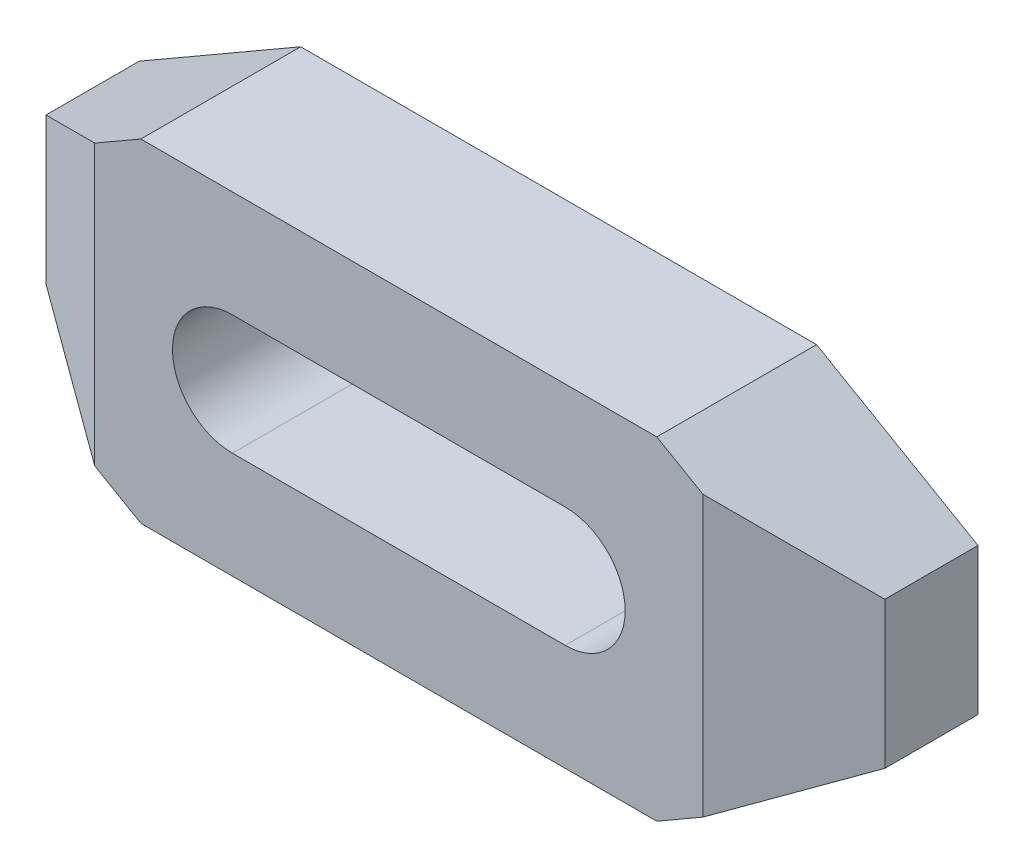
ISO-10303-21;
HEADER;
FILE_DESCRIPTION(('STEP AP214'),'2;1');
FILE_NAME('part.step','',(''),(''),'','','');
FILE_SCHEMA(('AUTOMOTIVE_DESIGN { 1 0 10303 214 1 1 1 1 }'));
ENDSEC;
DATA;
#1=APPLICATION_CONTEXT('core data for automotive mechanical design processes');
#2=APPLICATION_PROTOCOL_DEFINITION('international standard','automotive_design',2000,#1);
#3=PRODUCT_CONTEXT('',#1,'mechanical');
#4=PRODUCT('Part','Part','',(#3));
#5=PRODUCT_RELATED_PRODUCT_CATEGORY('part','',(#4));
#6=PRODUCT_DEFINITION_FORMATION('','',#4);
#7=PRODUCT_DEFINITION_CONTEXT('part definition',#1,'design');
#8=PRODUCT_DEFINITION('design','',#6,#7);
#9=PRODUCT_DEFINITION_SHAPE('','',#8);
#10=(LENGTH_UNIT() NAMED_UNIT(*) SI_UNIT(.MILLI.,.METRE.));
#11=(NAMED_UNIT(*) PLANE_ANGLE_UNIT() SI_UNIT($,.RADIAN.));
#12=(NAMED_UNIT(*) SI_UNIT($,.STERADIAN.) SOLID_ANGLE_UNIT());
#13=UNCERTAINTY_MEASURE_WITH_UNIT(LENGTH_MEASURE(1.E-05),#10,'distance_accuracy_value','');
#14=(GEOMETRIC_REPRESENTATION_CONTEXT(3) GLOBAL_UNCERTAINTY_ASSIGNED_CONTEXT((#13)) GLOBAL_UNIT_ASSIGNED_CONTEXT((#10,
#11,#12)) REPRESENTATION_CONTEXT('',''));
#15=CARTESIAN_POINT('',(0.,0.,0.));
#16=DIRECTION('',(0.,0.,1.));
#17=DIRECTION('',(1.,0.,0.));
#18=AXIS2_PLACEMENT_3D('',#15,#16,#17);
#19=CARTESIAN_POINT('',(0.,-23.6865334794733,12.));
#20=DIRECTION('',(0.,0.,-1.));
#21=DIRECTION('',(-1.,0.,0.));
#22=AXIS2_PLACEMENT_3D('',#19,#20,#21);
#23=PLANE('',#22);
#24=CARTESIAN_POINT('',(12.5,0.,12.));
#25=DIRECTION('',(0.,0.,1.));
#26=DIRECTION('',(1.,0.,0.));
#27=AXIS2_PLACEMENT_3D('',#24,#25,#26);
#28=CIRCLE('',#27,4.5);
#29=CARTESIAN_POINT('',(12.5,-4.5,12.));
#30=VERTEX_POINT('',#29);
#31=CARTESIAN_POINT('',(12.5,4.5,12.));
#32=VERTEX_POINT('',#31);
#33=EDGE_CURVE('E221',#30,#32,#28,.T.);
#34=ORIENTED_EDGE('',*,*,#33,.F.);
#35=DIRECTION('',(-1.,0.,0.));
#36=VECTOR('',#35,1.);
#37=CARTESIAN_POINT('',(12.5,-4.5,12.));
#38=LINE('',#37,#36);
#39=CARTESIAN_POINT('',(-12.5,-4.5,12.));
#40=VERTEX_POINT('',#39);
#41=EDGE_CURVE('E220',#30,#40,#38,.T.);
#42=ORIENTED_EDGE('',*,*,#41,.T.);
#43=CARTESIAN_POINT('',(-12.5,0.,12.));
#44=DIRECTION('',(0.,0.,1.));
#45=DIRECTION('',(1.,0.,0.));
#46=AXIS2_PLACEMENT_3D('',#43,#44,#45);
#47=CIRCLE('',#46,4.5);
#48=CARTESIAN_POINT('',(-12.5,4.5,12.));
#49=VERTEX_POINT('',#48);
#50=EDGE_CURVE('E228',#49,#40,#47,.T.);
#51=ORIENTED_EDGE('',*,*,#50,.F.);
#52=DIRECTION('',(-1.,0.,0.));
#53=VECTOR('',#52,1.);
#54=CARTESIAN_POINT('',(12.5,4.5,12.));
#55=LINE('',#54,#53);
#56=EDGE_CURVE('E224',#32,#49,#55,.T.);
#57=ORIENTED_EDGE('',*,*,#56,.F.);
#58=EDGE_LOOP('',(#34,#42,#51,#57));
#59=FACE_BOUND('',#58,.T.);
#60=DIRECTION('',(0.,1.,0.));
#61=VECTOR('',#60,1.);
#62=CARTESIAN_POINT('',(-22.8397459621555,-23.6865334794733,12.));
#63=LINE('',#62,#61);
#64=CARTESIAN_POINT('',(-22.8397459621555,-10.5,12.));
#65=VERTEX_POINT('',#64);
#66=CARTESIAN_POINT('',(-22.8397459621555,10.5,12.));
#67=VERTEX_POINT('',#66);
#68=EDGE_CURVE('E115',#65,#67,#63,.T.);
#69=ORIENTED_EDGE('',*,*,#68,.F.);
#70=DIRECTION('',(-0.866025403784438,0.5,0.));
#71=VECTOR('',#70,1.);
#72=CARTESIAN_POINT('',(-19.3756443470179,-12.5,12.));
#73=LINE('',#72,#71);
#74=CARTESIAN_POINT('',(-19.3756443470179,-12.5,12.));
#75=VERTEX_POINT('',#74);
#76=EDGE_CURVE('E174',#75,#65,#73,.T.);
#77=ORIENTED_EDGE('',*,*,#76,.F.);
#78=DIRECTION('',(-1.,0.,0.));
#79=VECTOR('',#78,1.);
#80=CARTESIAN_POINT('',(19.3756443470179,-12.5,12.));
#81=LINE('',#80,#79);
#82=CARTESIAN_POINT('',(19.3756443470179,-12.5,12.));
#83=VERTEX_POINT('',#82);
#84=EDGE_CURVE('E177',#83,#75,#81,.T.);
#85=ORIENTED_EDGE('',*,*,#84,.F.);
#86=DIRECTION('',(-0.866025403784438,-0.5,0.));
#87=VECTOR('',#86,1.);
#88=CARTESIAN_POINT('',(31.5,-5.5,12.));
#89=LINE('',#88,#87);
#90=CARTESIAN_POINT('',(22.8397459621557,-10.5,12.));
#91=VERTEX_POINT('',#90);
#92=EDGE_CURVE('E157',#91,#83,#89,.T.);
#93=ORIENTED_EDGE('',*,*,#92,.F.);
#94=DIRECTION('',(0.,1.,0.));
#95=VECTOR('',#94,1.);
#96=CARTESIAN_POINT('',(22.8397459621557,-23.6865334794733,12.));
#97=LINE('',#96,#95);
#98=CARTESIAN_POINT('',(22.8397459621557,10.5,12.));
#99=VERTEX_POINT('',#98);
#100=EDGE_CURVE('E146',#91,#99,#97,.T.);
#101=ORIENTED_EDGE('',*,*,#100,.T.);
#102=DIRECTION('',(0.866025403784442,-0.5,0.));
#103=VECTOR('',#102,1.);
#104=CARTESIAN_POINT('',(19.3756443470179,12.5,12.));
#105=LINE('',#104,#103);
#106=CARTESIAN_POINT('',(19.3756443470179,12.5,12.));
#107=VERTEX_POINT('',#106);
#108=EDGE_CURVE('E155',#107,#99,#105,.T.);
#109=ORIENTED_EDGE('',*,*,#108,.F.);
#110=DIRECTION('',(1.,0.,0.));
#111=VECTOR('',#110,1.);
#112=CARTESIAN_POINT('',(-19.3756443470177,12.5,12.));
#113=LINE('',#112,#111);
#114=CARTESIAN_POINT('',(-19.3756443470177,12.5,12.));
#115=VERTEX_POINT('',#114);
#116=EDGE_CURVE('E164',#115,#107,#113,.T.);
#117=ORIENTED_EDGE('',*,*,#116,.F.);
#118=DIRECTION('',(0.866025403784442,0.5,0.));
#119=VECTOR('',#118,1.);
#120=CARTESIAN_POINT('',(-31.5,5.5,12.));
#121=LINE('',#120,#119);
#122=EDGE_CURVE('E167',#67,#115,#121,.T.);
#123=ORIENTED_EDGE('',*,*,#122,.F.);
#124=EDGE_LOOP('',(#69,#77,#85,#93,#101,#109,#117,#123));
#125=FACE_BOUND('',#124,.T.);
#126=ADVANCED_FACE('F14',(#59,#125),#23,.F.);
#127=CARTESIAN_POINT('',(-31.5,5.5,12.));
#128=DIRECTION('',(-0.5,0.866025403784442,0.));
#129=DIRECTION('',(-0.866025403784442,-0.5,0.));
#130=AXIS2_PLACEMENT_3D('',#127,#128,#129);
#131=PLANE('',#130);
#132=DIRECTION('',(0.,0.,-1.));
#133=VECTOR('',#132,1.);
#134=CARTESIAN_POINT('',(-31.5,5.5,12.));
#135=LINE('',#134,#133);
#136=CARTESIAN_POINT('',(-31.5,5.5,7.));
#137=VERTEX_POINT('',#136);
#138=CARTESIAN_POINT('',(-31.5,5.5,0.));
#139=VERTEX_POINT('',#138);
#140=EDGE_CURVE('E124',#137,#139,#135,.T.);
#141=ORIENTED_EDGE('',*,*,#140,.F.);
#142=DIRECTION('',(0.774596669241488,0.447213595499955,0.447213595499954));
#143=VECTOR('',#142,1.);
#144=CARTESIAN_POINT('',(-29.7679491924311,6.5,8.));
#145=LINE('',#144,#143);
#146=EDGE_CURVE('E112',#137,#67,#145,.T.);
#147=ORIENTED_EDGE('',*,*,#146,.T.);
#148=ORIENTED_EDGE('',*,*,#122,.T.);
#149=DIRECTION('',(0.,0.,-1.));
#150=VECTOR('',#149,1.);
#151=CARTESIAN_POINT('',(-19.3756443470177,12.5,12.));
#152=LINE('',#151,#150);
#153=CARTESIAN_POINT('',(-19.3756443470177,12.5,0.));
#154=VERTEX_POINT('',#153);
#155=EDGE_CURVE('E132',#115,#154,#152,.T.);
#156=ORIENTED_EDGE('',*,*,#155,.T.);
#157=DIRECTION('',(0.866025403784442,0.5,0.));
#158=VECTOR('',#157,1.);
#159=CARTESIAN_POINT('',(-31.5,5.5,0.));
#160=LINE('',#159,#158);
#161=EDGE_CURVE('E131',#139,#154,#160,.T.);
#162=ORIENTED_EDGE('',*,*,#161,.F.);
#163=EDGE_LOOP('',(#141,#147,#148,#156,#162));
#164=FACE_BOUND('',#163,.T.);
#165=ADVANCED_FACE('F129',(#164),#131,.T.);
#166=CARTESIAN_POINT('',(-31.5,-5.5,12.));
#167=DIRECTION('',(-1.,0.,0.));
#168=DIRECTION('',(0.,0.,1.));
#169=AXIS2_PLACEMENT_3D('',#166,#167,#168);
#170=PLANE('',#169);
#171=DIRECTION('',(0.,0.,-1.));
#172=VECTOR('',#171,1.);
#173=CARTESIAN_POINT('',(-31.5,-5.5,12.));
#174=LINE('',#173,#172);
#175=CARTESIAN_POINT('',(-31.5,-5.5,7.));
#176=VERTEX_POINT('',#175);
#177=CARTESIAN_POINT('',(-31.5,-5.5,0.));
#178=VERTEX_POINT('',#177);
#179=EDGE_CURVE('E126',#176,#178,#174,.T.);
#180=ORIENTED_EDGE('',*,*,#179,.F.);
#181=DIRECTION('',(0.,1.,0.));
#182=VECTOR('',#181,1.);
#183=CARTESIAN_POINT('',(-31.5,-13.,7.));
#184=LINE('',#183,#182);
#185=EDGE_CURVE('E29',#176,#137,#184,.T.);
#186=ORIENTED_EDGE('',*,*,#185,.T.);
#187=ORIENTED_EDGE('',*,*,#140,.T.);
#188=DIRECTION('',(0.,1.,0.));
#189=VECTOR('',#188,1.);
#190=CARTESIAN_POINT('',(-31.5,-5.5,0.));
#191=LINE('',#190,#189);
#192=EDGE_CURVE('E199',#178,#139,#191,.T.);
#193=ORIENTED_EDGE('',*,*,#192,.F.);
#194=EDGE_LOOP('',(#180,#186,#187,#193));
#195=FACE_BOUND('',#194,.T.);
#196=ADVANCED_FACE('F122',(#195),#170,.T.);
#197=CARTESIAN_POINT('',(-19.3756443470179,-12.5,12.));
#198=DIRECTION('',(-0.5,-0.866025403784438,0.));
#199=DIRECTION('',(0.866025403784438,-0.5,0.));
#200=AXIS2_PLACEMENT_3D('',#197,#198,#199);
#201=PLANE('',#200);
#202=ORIENTED_EDGE('',*,*,#76,.T.);
#203=DIRECTION('',(-0.774596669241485,0.447213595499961,-0.447213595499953));
#204=VECTOR('',#203,1.);
#205=CARTESIAN_POINT('',(-20.0684646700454,-12.1,13.6));
#206=LINE('',#205,#204);
#207=EDGE_CURVE('E9',#65,#176,#206,.T.);
#208=ORIENTED_EDGE('',*,*,#207,.T.);
#209=ORIENTED_EDGE('',*,*,#179,.T.);
#210=DIRECTION('',(-0.866025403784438,0.5,0.));
#211=VECTOR('',#210,1.);
#212=CARTESIAN_POINT('',(-19.3756443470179,-12.5,0.));
#213=LINE('',#212,#211);
#214=CARTESIAN_POINT('',(-19.3756443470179,-12.5,0.));
#215=VERTEX_POINT('',#214);
#216=EDGE_CURVE('E195',#215,#178,#213,.T.);
#217=ORIENTED_EDGE('',*,*,#216,.F.);
#218=DIRECTION('',(0.,0.,-1.));
#219=VECTOR('',#218,1.);
#220=CARTESIAN_POINT('',(-19.3756443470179,-12.5,12.));
#221=LINE('',#220,#219);
#222=EDGE_CURVE('E136',#75,#215,#221,.T.);
#223=ORIENTED_EDGE('',*,*,#222,.F.);
#224=EDGE_LOOP('',(#202,#208,#209,#217,#223));
#225=FACE_BOUND('',#224,.T.);
#226=ADVANCED_FACE('F198',(#225),#201,.T.);
#227=CARTESIAN_POINT('',(0.,-23.6865334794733,0.));
#228=DIRECTION('',(0.,0.,-1.));
#229=DIRECTION('',(-1.,0.,0.));
#230=AXIS2_PLACEMENT_3D('',#227,#228,#229);
#231=PLANE('',#230);
#232=DIRECTION('',(-0.866025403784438,-0.5,0.));
#233=VECTOR('',#232,1.);
#234=CARTESIAN_POINT('',(31.5,-5.5,0.));
#235=LINE('',#234,#233);
#236=CARTESIAN_POINT('',(31.5,-5.5,0.));
#237=VERTEX_POINT('',#236);
#238=CARTESIAN_POINT('',(19.3756443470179,-12.5,0.));
#239=VERTEX_POINT('',#238);
#240=EDGE_CURVE('E170',#237,#239,#235,.T.);
#241=ORIENTED_EDGE('',*,*,#240,.T.);
#242=DIRECTION('',(-1.,0.,0.));
#243=VECTOR('',#242,1.);
#244=CARTESIAN_POINT('',(19.3756443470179,-12.5,0.));
#245=LINE('',#244,#243);
#246=EDGE_CURVE('E186',#239,#215,#245,.T.);
#247=ORIENTED_EDGE('',*,*,#246,.T.);
#248=ORIENTED_EDGE('',*,*,#216,.T.);
#249=ORIENTED_EDGE('',*,*,#192,.T.);
#250=ORIENTED_EDGE('',*,*,#161,.T.);
#251=DIRECTION('',(1.,0.,0.));
#252=VECTOR('',#251,1.);
#253=CARTESIAN_POINT('',(-19.3756443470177,12.5,0.));
#254=LINE('',#253,#252);
#255=CARTESIAN_POINT('',(19.3756443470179,12.5,0.));
#256=VERTEX_POINT('',#255);
#257=EDGE_CURVE('E204',#154,#256,#254,.T.);
#258=ORIENTED_EDGE('',*,*,#257,.T.);
#259=DIRECTION('',(0.866025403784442,-0.5,0.));
#260=VECTOR('',#259,1.);
#261=CARTESIAN_POINT('',(19.3756443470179,12.5,0.));
#262=LINE('',#261,#260);
#263=CARTESIAN_POINT('',(31.5,5.50000000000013,0.));
#264=VERTEX_POINT('',#263);
#265=EDGE_CURVE('E207',#256,#264,#262,.T.);
#266=ORIENTED_EDGE('',*,*,#265,.T.);
#267=DIRECTION('',(0.,-1.,0.));
#268=VECTOR('',#267,1.);
#269=CARTESIAN_POINT('',(31.5,5.50000000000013,0.));
#270=LINE('',#269,#268);
#271=EDGE_CURVE('E180',#264,#237,#270,.T.);
#272=ORIENTED_EDGE('',*,*,#271,.T.);
#273=EDGE_LOOP('',(#241,#247,#248,#249,#250,#258,#266,#272));
#274=FACE_BOUND('',#273,.T.);
#275=DIRECTION('',(-1.,0.,0.));
#276=VECTOR('',#275,1.);
#277=CARTESIAN_POINT('',(12.5,-4.5,0.));
#278=LINE('',#277,#276);
#279=CARTESIAN_POINT('',(12.5,-4.5,0.));
#280=VERTEX_POINT('',#279);
#281=CARTESIAN_POINT('',(-12.5,-4.5,0.));
#282=VERTEX_POINT('',#281);
#283=EDGE_CURVE('E225',#280,#282,#278,.T.);
#284=ORIENTED_EDGE('',*,*,#283,.F.);
#285=CARTESIAN_POINT('',(12.5,0.,0.));
#286=DIRECTION('',(0.,0.,1.));
#287=DIRECTION('',(1.,0.,0.));
#288=AXIS2_PLACEMENT_3D('',#285,#286,#287);
#289=CIRCLE('',#288,4.5);
#290=CARTESIAN_POINT('',(12.5,4.5,0.));
#291=VERTEX_POINT('',#290);
#292=EDGE_CURVE('E232',#280,#291,#289,.T.);
#293=ORIENTED_EDGE('',*,*,#292,.T.);
#294=DIRECTION('',(-1.,0.,0.));
#295=VECTOR('',#294,1.);
#296=CARTESIAN_POINT('',(12.5,4.5,0.));
#297=LINE('',#296,#295);
#298=CARTESIAN_POINT('',(-12.5,4.5,0.));
#299=VERTEX_POINT('',#298);
#300=EDGE_CURVE('E235',#291,#299,#297,.T.);
#301=ORIENTED_EDGE('',*,*,#300,.T.);
#302=CARTESIAN_POINT('',(-12.5,0.,0.));
#303=DIRECTION('',(0.,0.,1.));
#304=DIRECTION('',(1.,0.,0.));
#305=AXIS2_PLACEMENT_3D('',#302,#303,#304);
#306=CIRCLE('',#305,4.5);
#307=EDGE_CURVE('E238',#299,#282,#306,.T.);
#308=ORIENTED_EDGE('',*,*,#307,.T.);
#309=EDGE_LOOP('',(#284,#293,#301,#308));
#310=FACE_BOUND('',#309,.T.);
#311=ADVANCED_FACE('F193',(#274,#310),#231,.T.);
#312=CARTESIAN_POINT('',(31.5,-5.5,12.));
#313=DIRECTION('',(0.5,-0.866025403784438,0.));
#314=DIRECTION('',(0.866025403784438,0.5,0.));
#315=AXIS2_PLACEMENT_3D('',#312,#313,#314);
#316=PLANE('',#315);
#317=DIRECTION('',(0.774596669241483,0.447213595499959,-0.447213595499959));
#318=VECTOR('',#317,1.);
#319=CARTESIAN_POINT('',(29.7679491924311,-6.5,8.));
#320=LINE('',#319,#318);
#321=CARTESIAN_POINT('',(31.5,-5.5,7.));
#322=VERTEX_POINT('',#321);
#323=EDGE_CURVE('E158',#91,#322,#320,.T.);
#324=ORIENTED_EDGE('',*,*,#323,.F.);
#325=ORIENTED_EDGE('',*,*,#92,.T.);
#326=DIRECTION('',(0.,0.,-1.));
#327=VECTOR('',#326,1.);
#328=CARTESIAN_POINT('',(19.3756443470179,-12.5,12.));
#329=LINE('',#328,#327);
#330=EDGE_CURVE('E163',#83,#239,#329,.T.);
#331=ORIENTED_EDGE('',*,*,#330,.T.);
#332=ORIENTED_EDGE('',*,*,#240,.F.);
#333=DIRECTION('',(0.,0.,-1.));
#334=VECTOR('',#333,1.);
#335=CARTESIAN_POINT('',(31.5,-5.5,12.));
#336=LINE('',#335,#334);
#337=EDGE_CURVE('E143',#322,#237,#336,.T.);
#338=ORIENTED_EDGE('',*,*,#337,.F.);
#339=EDGE_LOOP('',(#324,#325,#331,#332,#338));
#340=FACE_BOUND('',#339,.T.);
#341=ADVANCED_FACE('F249',(#340),#316,.T.);
#342=CARTESIAN_POINT('',(31.5,5.50000000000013,12.));
#343=DIRECTION('',(1.,0.,0.));
#344=DIRECTION('',(0.,0.,-1.));
#345=AXIS2_PLACEMENT_3D('',#342,#343,#344);
#346=PLANE('',#345);
#347=DIRECTION('',(0.,1.,0.));
#348=VECTOR('',#347,1.);
#349=CARTESIAN_POINT('',(31.5,-13.,7.));
#350=LINE('',#349,#348);
#351=CARTESIAN_POINT('',(31.5,5.50000000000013,7.));
#352=VERTEX_POINT('',#351);
#353=EDGE_CURVE('E36',#322,#352,#350,.T.);
#354=ORIENTED_EDGE('',*,*,#353,.F.);
#355=ORIENTED_EDGE('',*,*,#337,.T.);
#356=ORIENTED_EDGE('',*,*,#271,.F.);
#357=DIRECTION('',(0.,0.,-1.));
#358=VECTOR('',#357,1.);
#359=CARTESIAN_POINT('',(31.5,5.50000000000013,12.));
#360=LINE('',#359,#358);
#361=EDGE_CURVE('E141',#352,#264,#360,.T.);
#362=ORIENTED_EDGE('',*,*,#361,.F.);
#363=EDGE_LOOP('',(#354,#355,#356,#362));
#364=FACE_BOUND('',#363,.T.);
#365=ADVANCED_FACE('F16',(#364),#346,.T.);
#366=CARTESIAN_POINT('',(19.3756443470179,12.5,12.));
#367=DIRECTION('',(0.5,0.866025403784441,0.));
#368=DIRECTION('',(-0.866025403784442,0.5,0.));
#369=AXIS2_PLACEMENT_3D('',#366,#367,#368);
#370=PLANE('',#369);
#371=DIRECTION('',(-0.774596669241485,0.447213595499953,0.44721359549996));
#372=VECTOR('',#371,1.);
#373=CARTESIAN_POINT('',(20.0684646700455,12.1,13.6));
#374=LINE('',#373,#372);
#375=EDGE_CURVE('E22',#352,#99,#374,.T.);
#376=ORIENTED_EDGE('',*,*,#375,.F.);
#377=ORIENTED_EDGE('',*,*,#361,.T.);
#378=ORIENTED_EDGE('',*,*,#265,.F.);
#379=DIRECTION('',(0.,0.,-1.));
#380=VECTOR('',#379,1.);
#381=CARTESIAN_POINT('',(19.3756443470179,12.5,12.));
#382=LINE('',#381,#380);
#383=EDGE_CURVE('E134',#107,#256,#382,.T.);
#384=ORIENTED_EDGE('',*,*,#383,.F.);
#385=ORIENTED_EDGE('',*,*,#108,.T.);
#386=EDGE_LOOP('',(#376,#377,#378,#384,#385));
#387=FACE_BOUND('',#386,.T.);
#388=ADVANCED_FACE('F160',(#387),#370,.T.);
#389=CARTESIAN_POINT('',(-19.3756443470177,12.5,12.));
#390=DIRECTION('',(0.,1.,0.));
#391=DIRECTION('',(0.,0.,1.));
#392=AXIS2_PLACEMENT_3D('',#389,#390,#391);
#393=PLANE('',#392);
#394=ORIENTED_EDGE('',*,*,#155,.F.);
#395=ORIENTED_EDGE('',*,*,#116,.T.);
#396=ORIENTED_EDGE('',*,*,#383,.T.);
#397=ORIENTED_EDGE('',*,*,#257,.F.);
#398=EDGE_LOOP('',(#394,#395,#396,#397));
#399=FACE_BOUND('',#398,.T.);
#400=ADVANCED_FACE('F253',(#399),#393,.T.);
#401=CARTESIAN_POINT('',(19.3756443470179,-12.5,12.));
#402=DIRECTION('',(0.,-1.,0.));
#403=DIRECTION('',(1.,0.,0.));
#404=AXIS2_PLACEMENT_3D('',#401,#402,#403);
#405=PLANE('',#404);
#406=ORIENTED_EDGE('',*,*,#84,.T.);
#407=ORIENTED_EDGE('',*,*,#222,.T.);
#408=ORIENTED_EDGE('',*,*,#246,.F.);
#409=ORIENTED_EDGE('',*,*,#330,.F.);
#410=EDGE_LOOP('',(#406,#407,#408,#409));
#411=FACE_BOUND('',#410,.T.);
#412=ADVANCED_FACE('F184',(#411),#405,.T.);
#413=CARTESIAN_POINT('',(12.5,0.,12.));
#414=DIRECTION('',(0.,0.,-1.));
#415=DIRECTION('',(-1.,0.,0.));
#416=AXIS2_PLACEMENT_3D('',#413,#414,#415);
#417=CYLINDRICAL_SURFACE('',#416,4.5);
#418=DIRECTION('',(0.,0.,-1.));
#419=VECTOR('',#418,1.);
#420=CARTESIAN_POINT('',(12.5,4.5,12.));
#421=LINE('',#420,#419);
#422=EDGE_CURVE('E211',#32,#291,#421,.T.);
#423=ORIENTED_EDGE('',*,*,#422,.T.);
#424=ORIENTED_EDGE('',*,*,#292,.F.);
#425=DIRECTION('',(0.,0.,-1.));
#426=VECTOR('',#425,1.);
#427=CARTESIAN_POINT('',(12.5,-4.5,12.));
#428=LINE('',#427,#426);
#429=EDGE_CURVE('E217',#30,#280,#428,.T.);
#430=ORIENTED_EDGE('',*,*,#429,.F.);
#431=ORIENTED_EDGE('',*,*,#33,.T.);
#432=EDGE_LOOP('',(#423,#424,#430,#431));
#433=FACE_BOUND('',#432,.T.);
#434=ADVANCED_FACE('F261',(#433),#417,.F.);
#435=CARTESIAN_POINT('',(12.5,4.5,12.));
#436=DIRECTION('',(0.,-1.,0.));
#437=DIRECTION('',(1.,0.,0.));
#438=AXIS2_PLACEMENT_3D('',#435,#436,#437);
#439=PLANE('',#438);
#440=DIRECTION('',(0.,0.,-1.));
#441=VECTOR('',#440,1.);
#442=CARTESIAN_POINT('',(-12.5,4.5,12.));
#443=LINE('',#442,#441);
#444=EDGE_CURVE('E213',#49,#299,#443,.T.);
#445=ORIENTED_EDGE('',*,*,#444,.T.);
#446=ORIENTED_EDGE('',*,*,#300,.F.);
#447=ORIENTED_EDGE('',*,*,#422,.F.);
#448=ORIENTED_EDGE('',*,*,#56,.T.);
#449=EDGE_LOOP('',(#445,#446,#447,#448));
#450=FACE_BOUND('',#449,.T.);
#451=ADVANCED_FACE('F336',(#450),#439,.T.);
#452=CARTESIAN_POINT('',(-12.5,0.,12.));
#453=DIRECTION('',(0.,0.,-1.));
#454=DIRECTION('',(-1.,0.,0.));
#455=AXIS2_PLACEMENT_3D('',#452,#453,#454);
#456=CYLINDRICAL_SURFACE('',#455,4.5);
#457=DIRECTION('',(0.,0.,-1.));
#458=VECTOR('',#457,1.);
#459=CARTESIAN_POINT('',(-12.5,-4.5,12.));
#460=LINE('',#459,#458);
#461=EDGE_CURVE('E215',#40,#282,#460,.T.);
#462=ORIENTED_EDGE('',*,*,#461,.T.);
#463=ORIENTED_EDGE('',*,*,#307,.F.);
#464=ORIENTED_EDGE('',*,*,#444,.F.);
#465=ORIENTED_EDGE('',*,*,#50,.T.);
#466=EDGE_LOOP('',(#462,#463,#464,#465));
#467=FACE_BOUND('',#466,.T.);
#468=ADVANCED_FACE('F346',(#467),#456,.F.);
#469=CARTESIAN_POINT('',(12.5,-4.5,12.));
#470=DIRECTION('',(0.,-1.,0.));
#471=DIRECTION('',(1.,0.,0.));
#472=AXIS2_PLACEMENT_3D('',#469,#470,#471);
#473=PLANE('',#472);
#474=ORIENTED_EDGE('',*,*,#41,.F.);
#475=ORIENTED_EDGE('',*,*,#429,.T.);
#476=ORIENTED_EDGE('',*,*,#283,.T.);
#477=ORIENTED_EDGE('',*,*,#461,.F.);
#478=EDGE_LOOP('',(#474,#475,#476,#477));
#479=FACE_BOUND('',#478,.T.);
#480=ADVANCED_FACE('F355',(#479),#473,.F.);
#481=CARTESIAN_POINT('',(31.5,-13.,7.));
#482=DIRECTION('',(-0.5,0.,-0.866025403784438));
#483=DIRECTION('',(-0.866025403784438,0.,0.5));
#484=AXIS2_PLACEMENT_3D('',#481,#482,#483);
#485=PLANE('',#484);
#486=ORIENTED_EDGE('',*,*,#323,.T.);
#487=ORIENTED_EDGE('',*,*,#353,.T.);
#488=ORIENTED_EDGE('',*,*,#375,.T.);
#489=ORIENTED_EDGE('',*,*,#100,.F.);
#490=EDGE_LOOP('',(#486,#487,#488,#489));
#491=FACE_BOUND('',#490,.T.);
#492=ADVANCED_FACE('F145',(#491),#485,.F.);
#493=CARTESIAN_POINT('',(-31.5,-13.,7.));
#494=DIRECTION('',(-0.5,0.,0.866025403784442));
#495=DIRECTION('',(0.866025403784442,0.,0.5));
#496=AXIS2_PLACEMENT_3D('',#493,#494,#495);
#497=PLANE('',#496);
#498=ORIENTED_EDGE('',*,*,#185,.F.);
#499=ORIENTED_EDGE('',*,*,#207,.F.);
#500=ORIENTED_EDGE('',*,*,#68,.T.);
#501=ORIENTED_EDGE('',*,*,#146,.F.);
#502=EDGE_LOOP('',(#498,#499,#500,#501));
#503=FACE_BOUND('',#502,.T.);
#504=ADVANCED_FACE('F113',(#503),#497,.T.);
#505=CLOSED_SHELL('',(#126,#165,#196,#226,#311,#341,#365,#388,#400,#412,#434,#451,#468,#480,
#492,#504));
#506=MANIFOLD_SOLID_BREP('B1',#505);
#507=ADVANCED_BREP_SHAPE_REPRESENTATION('',(#18,#506),#14);
#508=SHAPE_DEFINITION_REPRESENTATION(#9,#507);
ENDSEC;
END-ISO-10303-21;
